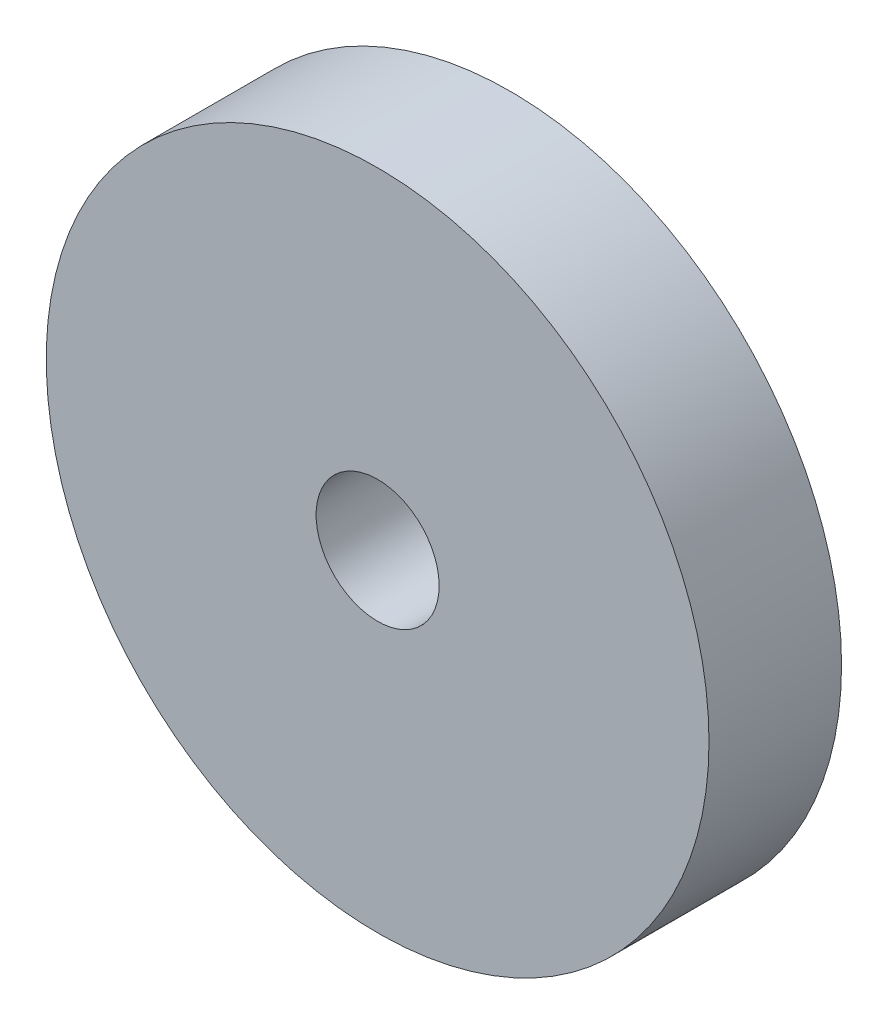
ISO-10303-21;
HEADER;
FILE_DESCRIPTION(('STEP AP214'),'2;1');
FILE_NAME('part.step','',(''),(''),'','','');
FILE_SCHEMA(('AUTOMOTIVE_DESIGN { 1 0 10303 214 1 1 1 1 }'));
ENDSEC;
DATA;
#1=APPLICATION_CONTEXT('core data for automotive mechanical design processes');
#2=APPLICATION_PROTOCOL_DEFINITION('international standard','automotive_design',2000,#1);
#3=PRODUCT_CONTEXT('',#1,'mechanical');
#4=PRODUCT('Part','Part','',(#3));
#5=PRODUCT_RELATED_PRODUCT_CATEGORY('part','',(#4));
#6=PRODUCT_DEFINITION_FORMATION('','',#4);
#7=PRODUCT_DEFINITION_CONTEXT('part definition',#1,'design');
#8=PRODUCT_DEFINITION('design','',#6,#7);
#9=PRODUCT_DEFINITION_SHAPE('','',#8);
#10=(LENGTH_UNIT() NAMED_UNIT(*) SI_UNIT(.MILLI.,.METRE.));
#11=(NAMED_UNIT(*) PLANE_ANGLE_UNIT() SI_UNIT($,.RADIAN.));
#12=(NAMED_UNIT(*) SI_UNIT($,.STERADIAN.) SOLID_ANGLE_UNIT());
#13=UNCERTAINTY_MEASURE_WITH_UNIT(LENGTH_MEASURE(1.E-05),#10,'distance_accuracy_value','');
#14=(GEOMETRIC_REPRESENTATION_CONTEXT(3) GLOBAL_UNCERTAINTY_ASSIGNED_CONTEXT((#13)) GLOBAL_UNIT_ASSIGNED_CONTEXT((#10,
#11,#12)) REPRESENTATION_CONTEXT('',''));
#15=CARTESIAN_POINT('',(0.,0.,0.));
#16=DIRECTION('',(0.,0.,1.));
#17=DIRECTION('',(1.,0.,0.));
#18=AXIS2_PLACEMENT_3D('',#15,#16,#17);
#19=CARTESIAN_POINT('',(0.,0.,3.175));
#20=DIRECTION('',(0.,0.,-1.));
#21=DIRECTION('',(-1.,0.,0.));
#22=AXIS2_PLACEMENT_3D('',#19,#20,#21);
#23=CYLINDRICAL_SURFACE('',#22,7.9375);
#24=CARTESIAN_POINT('',(0.,0.,3.175));
#25=DIRECTION('',(0.,0.,1.));
#26=DIRECTION('',(1.,0.,0.));
#27=AXIS2_PLACEMENT_3D('',#24,#25,#26);
#28=CIRCLE('',#27,7.9375);
#29=CARTESIAN_POINT('',(7.9375,0.,3.175));
#30=VERTEX_POINT('',#29);
#31=EDGE_CURVE('E10',#30,#30,#28,.T.);
#32=ORIENTED_EDGE('',*,*,#31,.F.);
#33=EDGE_LOOP('',(#32));
#34=FACE_BOUND('',#33,.T.);
#35=CARTESIAN_POINT('',(0.,0.,0.));
#36=DIRECTION('',(0.,0.,1.));
#37=DIRECTION('',(1.,0.,0.));
#38=AXIS2_PLACEMENT_3D('',#35,#36,#37);
#39=CIRCLE('',#38,7.9375);
#40=CARTESIAN_POINT('',(7.9375,0.,0.));
#41=VERTEX_POINT('',#40);
#42=EDGE_CURVE('E33',#41,#41,#39,.T.);
#43=ORIENTED_EDGE('',*,*,#42,.T.);
#44=EDGE_LOOP('',(#43));
#45=FACE_BOUND('',#44,.T.);
#46=ADVANCED_FACE('F30',(#34,#45),#23,.T.);
#47=CARTESIAN_POINT('',(0.,0.,3.175));
#48=DIRECTION('',(0.,0.,1.));
#49=DIRECTION('',(1.,0.,0.));
#50=AXIS2_PLACEMENT_3D('',#47,#48,#49);
#51=PLANE('',#50);
#52=CARTESIAN_POINT('',(0.,0.,3.175));
#53=DIRECTION('',(0.,0.,1.));
#54=DIRECTION('',(1.,0.,0.));
#55=AXIS2_PLACEMENT_3D('',#52,#53,#54);
#56=CIRCLE('',#55,1.47319999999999);
#57=CARTESIAN_POINT('',(1.47319999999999,0.,3.175));
#58=VERTEX_POINT('',#57);
#59=EDGE_CURVE('E44',#58,#58,#56,.T.);
#60=ORIENTED_EDGE('',*,*,#59,.F.);
#61=EDGE_LOOP('',(#60));
#62=FACE_BOUND('',#61,.T.);
#63=ORIENTED_EDGE('',*,*,#31,.T.);
#64=EDGE_LOOP('',(#63));
#65=FACE_BOUND('',#64,.T.);
#66=ADVANCED_FACE('F50',(#62,#65),#51,.T.);
#67=CARTESIAN_POINT('',(0.,0.,0.));
#68=DIRECTION('',(0.,0.,1.));
#69=DIRECTION('',(1.,0.,0.));
#70=AXIS2_PLACEMENT_3D('',#67,#68,#69);
#71=PLANE('',#70);
#72=CARTESIAN_POINT('',(0.,0.,0.));
#73=DIRECTION('',(0.,0.,1.));
#74=DIRECTION('',(1.,0.,0.));
#75=AXIS2_PLACEMENT_3D('',#72,#73,#74);
#76=CIRCLE('',#75,1.4732);
#77=CARTESIAN_POINT('',(1.4732,0.,0.));
#78=VERTEX_POINT('',#77);
#79=EDGE_CURVE('E40',#78,#78,#76,.T.);
#80=ORIENTED_EDGE('',*,*,#79,.T.);
#81=EDGE_LOOP('',(#80));
#82=FACE_BOUND('',#81,.T.);
#83=ORIENTED_EDGE('',*,*,#42,.F.);
#84=EDGE_LOOP('',(#83));
#85=FACE_BOUND('',#84,.T.);
#86=ADVANCED_FACE('F52',(#82,#85),#71,.F.);
#87=CARTESIAN_POINT('',(0.,0.,3.175));
#88=DIRECTION('',(0.,0.,1.));
#89=DIRECTION('',(1.,0.,0.));
#90=AXIS2_PLACEMENT_3D('',#87,#88,#89);
#91=CYLINDRICAL_SURFACE('',#90,1.47319999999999);
#92=ORIENTED_EDGE('',*,*,#79,.F.);
#93=EDGE_LOOP('',(#92));
#94=FACE_BOUND('',#93,.T.);
#95=ORIENTED_EDGE('',*,*,#59,.T.);
#96=EDGE_LOOP('',(#95));
#97=FACE_BOUND('',#96,.T.);
#98=ADVANCED_FACE('F48',(#94,#97),#91,.F.);
#99=CLOSED_SHELL('',(#46,#66,#86,#98));
#100=MANIFOLD_SOLID_BREP('B2',#99);
#101=ADVANCED_BREP_SHAPE_REPRESENTATION('',(#18,#100),#14);
#102=SHAPE_DEFINITION_REPRESENTATION(#9,#101);
ENDSEC;
END-ISO-10303-21;
